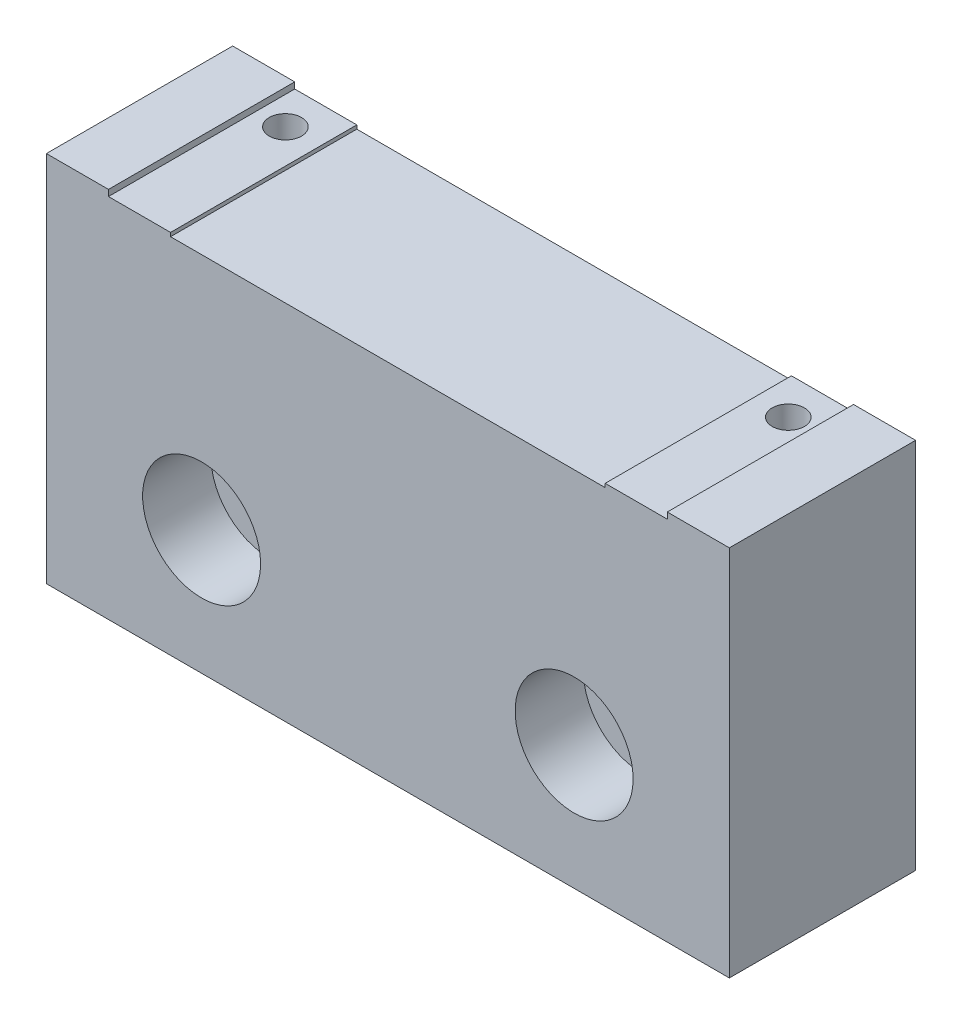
from build123d import *

# Parameters (mm, degrees)
SKETCH_1_R          = 2.75
EXTRUDE_1_DEPTH     = 15
SKETCH_2_R          = 4.75
CUT_EXTRUDE_1_DEPTH = 5.5
SKETCH_3_R          = 1.3
CUT_EXTRUDE_2_DEPTH = 65.420493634


with BuildPart() as part:
    # Sketch 1 → Extrude 1 (new body)
    with BuildSketch(Plane.XY):
        Polygon((0, 0), (0, 30), (5, 30), (5, 29.5), (10, 29.5), (10, 29.2), (45, 29.2), (45, 29.5), (50, 29.5), (50, 30), (55, 30), (55, 0), align=None)
        with Locations((12.5, 10)):
            Circle(SKETCH_1_R, mode=Mode.SUBTRACT)
        with Locations((42.5, 10)):
            Circle(SKETCH_1_R, mode=Mode.SUBTRACT)
    extrude(amount=EXTRUDE_1_DEPTH)

    # Sketch 2 → Cut-Extrude 1 (cut)
    with BuildSketch(Plane.XY.offset(15)):
        with Locations((12.5, 10)):
            Circle(SKETCH_2_R)
        with Locations((42.5, 10)):
            Circle(SKETCH_2_R)
    extrude(amount=-CUT_EXTRUDE_1_DEPTH, mode=Mode.SUBTRACT)

    # Sketch 3 → Cut-Extrude 2 (cut, through all)
    with BuildSketch(Plane(origin=(0, 30, 0), x_dir=(1, 0, 0), z_dir=(0, 1, 0))):
        with Locations(Location((47.758722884, -3.012040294, 0), (0, 0, 270))):
            Circle(SKETCH_3_R)
        with Locations(Location((7.258722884, -3.012040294, 0), (0, 0, 270))):
            Circle(SKETCH_3_R)
    extrude(amount=-CUT_EXTRUDE_2_DEPTH, mode=Mode.SUBTRACT)


solid = part.part
